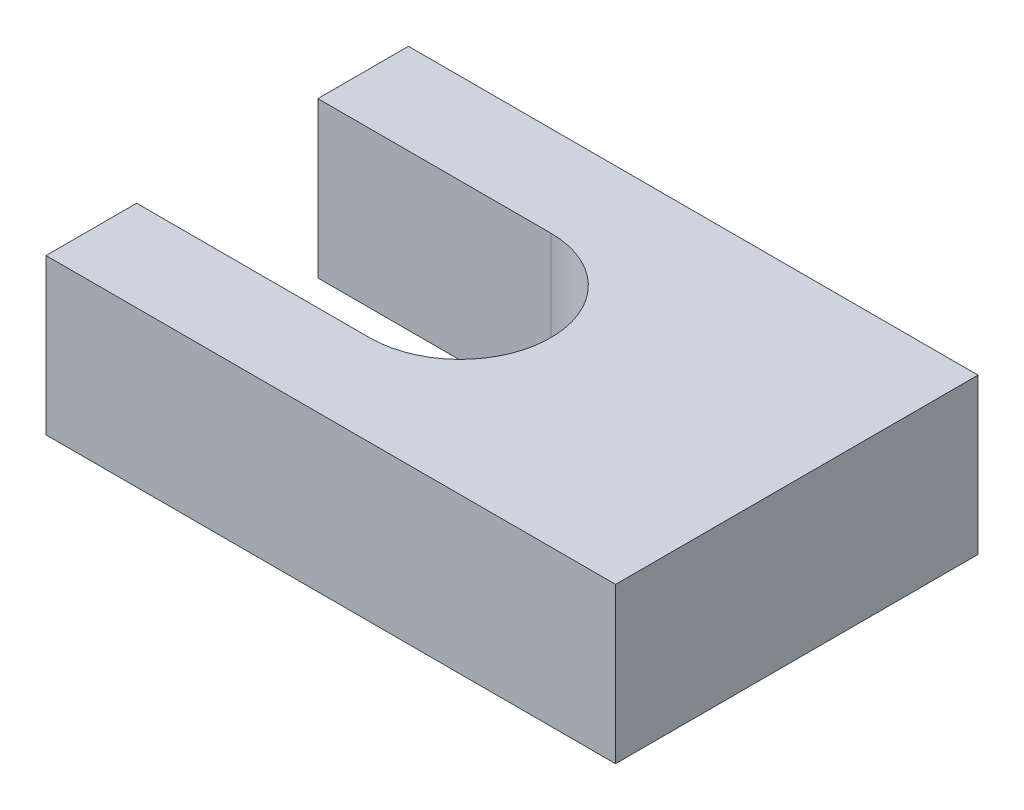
ISO-10303-21;
HEADER;
FILE_DESCRIPTION(('STEP AP214'),'2;1');
FILE_NAME('part.step','',(''),(''),'','','');
FILE_SCHEMA(('AUTOMOTIVE_DESIGN { 1 0 10303 214 1 1 1 1 }'));
ENDSEC;
DATA;
#1=APPLICATION_CONTEXT('core data for automotive mechanical design processes');
#2=APPLICATION_PROTOCOL_DEFINITION('international standard','automotive_design',2000,#1);
#3=PRODUCT_CONTEXT('',#1,'mechanical');
#4=PRODUCT('Part','Part','',(#3));
#5=PRODUCT_RELATED_PRODUCT_CATEGORY('part','',(#4));
#6=PRODUCT_DEFINITION_FORMATION('','',#4);
#7=PRODUCT_DEFINITION_CONTEXT('part definition',#1,'design');
#8=PRODUCT_DEFINITION('design','',#6,#7);
#9=PRODUCT_DEFINITION_SHAPE('','',#8);
#10=(LENGTH_UNIT() NAMED_UNIT(*) SI_UNIT(.MILLI.,.METRE.));
#11=(NAMED_UNIT(*) PLANE_ANGLE_UNIT() SI_UNIT($,.RADIAN.));
#12=(NAMED_UNIT(*) SI_UNIT($,.STERADIAN.) SOLID_ANGLE_UNIT());
#13=UNCERTAINTY_MEASURE_WITH_UNIT(LENGTH_MEASURE(1.E-05),#10,'distance_accuracy_value','');
#14=(GEOMETRIC_REPRESENTATION_CONTEXT(3) GLOBAL_UNCERTAINTY_ASSIGNED_CONTEXT((#13)) GLOBAL_UNIT_ASSIGNED_CONTEXT((#10,
#11,#12)) REPRESENTATION_CONTEXT('',''));
#15=CARTESIAN_POINT('',(0.,0.,0.));
#16=DIRECTION('',(0.,0.,1.));
#17=DIRECTION('',(1.,0.,0.));
#18=AXIS2_PLACEMENT_3D('',#15,#16,#17);
#19=CARTESIAN_POINT('',(0.,30.,0.));
#20=DIRECTION('',(0.,-1.,0.));
#21=DIRECTION('',(0.,0.,-1.));
#22=AXIS2_PLACEMENT_3D('',#19,#20,#21);
#23=CYLINDRICAL_SURFACE('',#22,17.5);
#24=CARTESIAN_POINT('',(0.,0.,0.));
#25=DIRECTION('',(0.,-1.,0.));
#26=DIRECTION('',(0.,0.,1.));
#27=AXIS2_PLACEMENT_3D('',#24,#25,#26);
#28=CIRCLE('',#27,17.5);
#29=CARTESIAN_POINT('',(0.,0.,-17.5));
#30=VERTEX_POINT('',#29);
#31=CARTESIAN_POINT('',(0.,0.,17.5));
#32=VERTEX_POINT('',#31);
#33=EDGE_CURVE('E127',#30,#32,#28,.T.);
#34=ORIENTED_EDGE('',*,*,#33,.T.);
#35=DIRECTION('',(0.,-1.,0.));
#36=VECTOR('',#35,1.);
#37=CARTESIAN_POINT('',(0.,30.,17.5));
#38=LINE('',#37,#36);
#39=CARTESIAN_POINT('',(0.,30.,17.5));
#40=VERTEX_POINT('',#39);
#41=EDGE_CURVE('E11',#40,#32,#38,.T.);
#42=ORIENTED_EDGE('',*,*,#41,.F.);
#43=CARTESIAN_POINT('',(0.,30.,0.));
#44=DIRECTION('',(0.,-1.,0.));
#45=DIRECTION('',(0.,0.,1.));
#46=AXIS2_PLACEMENT_3D('',#43,#44,#45);
#47=CIRCLE('',#46,17.5);
#48=CARTESIAN_POINT('',(0.,30.,-17.5));
#49=VERTEX_POINT('',#48);
#50=EDGE_CURVE('E141',#49,#40,#47,.T.);
#51=ORIENTED_EDGE('',*,*,#50,.F.);
#52=DIRECTION('',(0.,-1.,0.));
#53=VECTOR('',#52,1.);
#54=CARTESIAN_POINT('',(0.,30.,-17.5));
#55=LINE('',#54,#53);
#56=EDGE_CURVE('E123',#49,#30,#55,.T.);
#57=ORIENTED_EDGE('',*,*,#56,.T.);
#58=EDGE_LOOP('',(#34,#42,#51,#57));
#59=FACE_BOUND('',#58,.T.);
#60=ADVANCED_FACE('F31',(#59),#23,.F.);
#61=CARTESIAN_POINT('',(-45.,30.,17.5));
#62=DIRECTION('',(0.,0.,1.));
#63=DIRECTION('',(1.,0.,0.));
#64=AXIS2_PLACEMENT_3D('',#61,#62,#63);
#65=PLANE('',#64);
#66=DIRECTION('',(-1.,0.,0.));
#67=VECTOR('',#66,1.);
#68=CARTESIAN_POINT('',(-45.,0.,17.5));
#69=LINE('',#68,#67);
#70=CARTESIAN_POINT('',(-45.,0.,17.5));
#71=VERTEX_POINT('',#70);
#72=EDGE_CURVE('E130',#32,#71,#69,.T.);
#73=ORIENTED_EDGE('',*,*,#72,.T.);
#74=DIRECTION('',(0.,-1.,0.));
#75=VECTOR('',#74,1.);
#76=CARTESIAN_POINT('',(-45.,30.,17.5));
#77=LINE('',#76,#75);
#78=CARTESIAN_POINT('',(-45.,30.,17.5));
#79=VERTEX_POINT('',#78);
#80=EDGE_CURVE('E39',#79,#71,#77,.T.);
#81=ORIENTED_EDGE('',*,*,#80,.F.);
#82=DIRECTION('',(-1.,0.,0.));
#83=VECTOR('',#82,1.);
#84=CARTESIAN_POINT('',(-45.,30.,17.5));
#85=LINE('',#84,#83);
#86=EDGE_CURVE('E90',#40,#79,#85,.T.);
#87=ORIENTED_EDGE('',*,*,#86,.F.);
#88=ORIENTED_EDGE('',*,*,#41,.T.);
#89=EDGE_LOOP('',(#73,#81,#87,#88));
#90=FACE_BOUND('',#89,.T.);
#91=ADVANCED_FACE('F176',(#90),#65,.F.);
#92=CARTESIAN_POINT('',(-45.,30.,35.));
#93=DIRECTION('',(1.,0.,0.));
#94=DIRECTION('',(0.,0.,-1.));
#95=AXIS2_PLACEMENT_3D('',#92,#93,#94);
#96=PLANE('',#95);
#97=DIRECTION('',(0.,0.,1.));
#98=VECTOR('',#97,1.);
#99=CARTESIAN_POINT('',(-45.,0.,35.));
#100=LINE('',#99,#98);
#101=CARTESIAN_POINT('',(-45.,0.,35.));
#102=VERTEX_POINT('',#101);
#103=EDGE_CURVE('E132',#71,#102,#100,.T.);
#104=ORIENTED_EDGE('',*,*,#103,.T.);
#105=DIRECTION('',(0.,-1.,0.));
#106=VECTOR('',#105,1.);
#107=CARTESIAN_POINT('',(-45.,30.,35.));
#108=LINE('',#107,#106);
#109=CARTESIAN_POINT('',(-45.,30.,35.));
#110=VERTEX_POINT('',#109);
#111=EDGE_CURVE('E148',#110,#102,#108,.T.);
#112=ORIENTED_EDGE('',*,*,#111,.F.);
#113=DIRECTION('',(0.,0.,1.));
#114=VECTOR('',#113,1.);
#115=CARTESIAN_POINT('',(-45.,30.,35.));
#116=LINE('',#115,#114);
#117=EDGE_CURVE('E156',#79,#110,#116,.T.);
#118=ORIENTED_EDGE('',*,*,#117,.F.);
#119=ORIENTED_EDGE('',*,*,#80,.T.);
#120=EDGE_LOOP('',(#104,#112,#118,#119));
#121=FACE_BOUND('',#120,.T.);
#122=ADVANCED_FACE('F154',(#121),#96,.F.);
#123=CARTESIAN_POINT('',(65.,30.,35.));
#124=DIRECTION('',(0.,0.,-1.));
#125=DIRECTION('',(-1.,0.,0.));
#126=AXIS2_PLACEMENT_3D('',#123,#124,#125);
#127=PLANE('',#126);
#128=DIRECTION('',(1.,0.,0.));
#129=VECTOR('',#128,1.);
#130=CARTESIAN_POINT('',(65.,0.,35.));
#131=LINE('',#130,#129);
#132=CARTESIAN_POINT('',(65.,0.,35.));
#133=VERTEX_POINT('',#132);
#134=EDGE_CURVE('E134',#102,#133,#131,.T.);
#135=ORIENTED_EDGE('',*,*,#134,.T.);
#136=DIRECTION('',(0.,-1.,0.));
#137=VECTOR('',#136,1.);
#138=CARTESIAN_POINT('',(65.,30.,35.));
#139=LINE('',#138,#137);
#140=CARTESIAN_POINT('',(65.,30.,35.));
#141=VERTEX_POINT('',#140);
#142=EDGE_CURVE('E145',#141,#133,#139,.T.);
#143=ORIENTED_EDGE('',*,*,#142,.F.);
#144=DIRECTION('',(1.,0.,0.));
#145=VECTOR('',#144,1.);
#146=CARTESIAN_POINT('',(65.,30.,35.));
#147=LINE('',#146,#145);
#148=EDGE_CURVE('E168',#110,#141,#147,.T.);
#149=ORIENTED_EDGE('',*,*,#148,.F.);
#150=ORIENTED_EDGE('',*,*,#111,.T.);
#151=EDGE_LOOP('',(#135,#143,#149,#150));
#152=FACE_BOUND('',#151,.T.);
#153=ADVANCED_FACE('F164',(#152),#127,.F.);
#154=CARTESIAN_POINT('',(65.,30.,-35.));
#155=DIRECTION('',(-1.,0.,0.));
#156=DIRECTION('',(0.,0.,1.));
#157=AXIS2_PLACEMENT_3D('',#154,#155,#156);
#158=PLANE('',#157);
#159=DIRECTION('',(0.,0.,-1.));
#160=VECTOR('',#159,1.);
#161=CARTESIAN_POINT('',(65.,0.,-35.));
#162=LINE('',#161,#160);
#163=CARTESIAN_POINT('',(65.,0.,-35.));
#164=VERTEX_POINT('',#163);
#165=EDGE_CURVE('E136',#133,#164,#162,.T.);
#166=ORIENTED_EDGE('',*,*,#165,.T.);
#167=DIRECTION('',(0.,-1.,0.));
#168=VECTOR('',#167,1.);
#169=CARTESIAN_POINT('',(65.,30.,-35.));
#170=LINE('',#169,#168);
#171=CARTESIAN_POINT('',(65.,30.,-35.));
#172=VERTEX_POINT('',#171);
#173=EDGE_CURVE('E118',#172,#164,#170,.T.);
#174=ORIENTED_EDGE('',*,*,#173,.F.);
#175=DIRECTION('',(0.,0.,-1.));
#176=VECTOR('',#175,1.);
#177=CARTESIAN_POINT('',(65.,30.,-35.));
#178=LINE('',#177,#176);
#179=EDGE_CURVE('E109',#141,#172,#178,.T.);
#180=ORIENTED_EDGE('',*,*,#179,.F.);
#181=ORIENTED_EDGE('',*,*,#142,.T.);
#182=EDGE_LOOP('',(#166,#174,#180,#181));
#183=FACE_BOUND('',#182,.T.);
#184=ADVANCED_FACE('F167',(#183),#158,.F.);
#185=CARTESIAN_POINT('',(-45.,30.,-35.));
#186=DIRECTION('',(0.,0.,1.));
#187=DIRECTION('',(1.,0.,0.));
#188=AXIS2_PLACEMENT_3D('',#185,#186,#187);
#189=PLANE('',#188);
#190=DIRECTION('',(-1.,0.,0.));
#191=VECTOR('',#190,1.);
#192=CARTESIAN_POINT('',(-45.,0.,-35.));
#193=LINE('',#192,#191);
#194=CARTESIAN_POINT('',(-45.,0.,-35.));
#195=VERTEX_POINT('',#194);
#196=EDGE_CURVE('E117',#164,#195,#193,.T.);
#197=ORIENTED_EDGE('',*,*,#196,.T.);
#198=DIRECTION('',(0.,-1.,0.));
#199=VECTOR('',#198,1.);
#200=CARTESIAN_POINT('',(-45.,30.,-35.));
#201=LINE('',#200,#199);
#202=CARTESIAN_POINT('',(-45.,30.,-35.));
#203=VERTEX_POINT('',#202);
#204=EDGE_CURVE('E114',#203,#195,#201,.T.);
#205=ORIENTED_EDGE('',*,*,#204,.F.);
#206=DIRECTION('',(-1.,0.,0.));
#207=VECTOR('',#206,1.);
#208=CARTESIAN_POINT('',(-45.,30.,-35.));
#209=LINE('',#208,#207);
#210=EDGE_CURVE('E103',#172,#203,#209,.T.);
#211=ORIENTED_EDGE('',*,*,#210,.F.);
#212=ORIENTED_EDGE('',*,*,#173,.T.);
#213=EDGE_LOOP('',(#197,#205,#211,#212));
#214=FACE_BOUND('',#213,.T.);
#215=ADVANCED_FACE('F115',(#214),#189,.F.);
#216=CARTESIAN_POINT('',(-45.,30.,-17.5));
#217=DIRECTION('',(1.,0.,0.));
#218=DIRECTION('',(0.,0.,-1.));
#219=AXIS2_PLACEMENT_3D('',#216,#217,#218);
#220=PLANE('',#219);
#221=DIRECTION('',(0.,0.,1.));
#222=VECTOR('',#221,1.);
#223=CARTESIAN_POINT('',(-45.,0.,-17.5));
#224=LINE('',#223,#222);
#225=CARTESIAN_POINT('',(-45.,0.,-17.5));
#226=VERTEX_POINT('',#225);
#227=EDGE_CURVE('E76',#195,#226,#224,.T.);
#228=ORIENTED_EDGE('',*,*,#227,.T.);
#229=DIRECTION('',(0.,-1.,0.));
#230=VECTOR('',#229,1.);
#231=CARTESIAN_POINT('',(-45.,30.,-17.5));
#232=LINE('',#231,#230);
#233=CARTESIAN_POINT('',(-45.,30.,-17.5));
#234=VERTEX_POINT('',#233);
#235=EDGE_CURVE('E119',#234,#226,#232,.T.);
#236=ORIENTED_EDGE('',*,*,#235,.F.);
#237=DIRECTION('',(0.,0.,1.));
#238=VECTOR('',#237,1.);
#239=CARTESIAN_POINT('',(-45.,30.,-17.5));
#240=LINE('',#239,#238);
#241=EDGE_CURVE('E107',#203,#234,#240,.T.);
#242=ORIENTED_EDGE('',*,*,#241,.F.);
#243=ORIENTED_EDGE('',*,*,#204,.T.);
#244=EDGE_LOOP('',(#228,#236,#242,#243));
#245=FACE_BOUND('',#244,.T.);
#246=ADVANCED_FACE('F121',(#245),#220,.F.);
#247=CARTESIAN_POINT('',(0.,30.,-17.5));
#248=DIRECTION('',(0.,0.,-1.));
#249=DIRECTION('',(-1.,0.,0.));
#250=AXIS2_PLACEMENT_3D('',#247,#248,#249);
#251=PLANE('',#250);
#252=DIRECTION('',(1.,0.,0.));
#253=VECTOR('',#252,1.);
#254=CARTESIAN_POINT('',(0.,0.,-17.5));
#255=LINE('',#254,#253);
#256=EDGE_CURVE('E82',#226,#30,#255,.T.);
#257=ORIENTED_EDGE('',*,*,#256,.T.);
#258=ORIENTED_EDGE('',*,*,#56,.F.);
#259=DIRECTION('',(1.,0.,0.));
#260=VECTOR('',#259,1.);
#261=CARTESIAN_POINT('',(0.,30.,-17.5));
#262=LINE('',#261,#260);
#263=EDGE_CURVE('E47',#234,#49,#262,.T.);
#264=ORIENTED_EDGE('',*,*,#263,.F.);
#265=ORIENTED_EDGE('',*,*,#235,.T.);
#266=EDGE_LOOP('',(#257,#258,#264,#265));
#267=FACE_BOUND('',#266,.T.);
#268=ADVANCED_FACE('F192',(#267),#251,.F.);
#269=CARTESIAN_POINT('',(0.,30.,0.));
#270=DIRECTION('',(0.,1.,0.));
#271=DIRECTION('',(0.,0.,1.));
#272=AXIS2_PLACEMENT_3D('',#269,#270,#271);
#273=PLANE('',#272);
#274=ORIENTED_EDGE('',*,*,#50,.T.);
#275=ORIENTED_EDGE('',*,*,#86,.T.);
#276=ORIENTED_EDGE('',*,*,#117,.T.);
#277=ORIENTED_EDGE('',*,*,#148,.T.);
#278=ORIENTED_EDGE('',*,*,#179,.T.);
#279=ORIENTED_EDGE('',*,*,#210,.T.);
#280=ORIENTED_EDGE('',*,*,#241,.T.);
#281=ORIENTED_EDGE('',*,*,#263,.T.);
#282=EDGE_LOOP('',(#274,#275,#276,#277,#278,#279,#280,#281));
#283=FACE_BOUND('',#282,.T.);
#284=ADVANCED_FACE('F105',(#283),#273,.T.);
#285=CARTESIAN_POINT('',(0.,0.,0.));
#286=DIRECTION('',(0.,1.,0.));
#287=DIRECTION('',(0.,0.,1.));
#288=AXIS2_PLACEMENT_3D('',#285,#286,#287);
#289=PLANE('',#288);
#290=ORIENTED_EDGE('',*,*,#33,.F.);
#291=ORIENTED_EDGE('',*,*,#256,.F.);
#292=ORIENTED_EDGE('',*,*,#227,.F.);
#293=ORIENTED_EDGE('',*,*,#196,.F.);
#294=ORIENTED_EDGE('',*,*,#165,.F.);
#295=ORIENTED_EDGE('',*,*,#134,.F.);
#296=ORIENTED_EDGE('',*,*,#103,.F.);
#297=ORIENTED_EDGE('',*,*,#72,.F.);
#298=EDGE_LOOP('',(#290,#291,#292,#293,#294,#295,#296,#297));
#299=FACE_BOUND('',#298,.T.);
#300=ADVANCED_FACE('F160',(#299),#289,.F.);
#301=CLOSED_SHELL('',(#60,#91,#122,#153,#184,#215,#246,#268,#284,#300));
#302=MANIFOLD_SOLID_BREP('B2',#301);
#303=ADVANCED_BREP_SHAPE_REPRESENTATION('',(#18,#302),#14);
#304=SHAPE_DEFINITION_REPRESENTATION(#9,#303);
ENDSEC;
END-ISO-10303-21;
